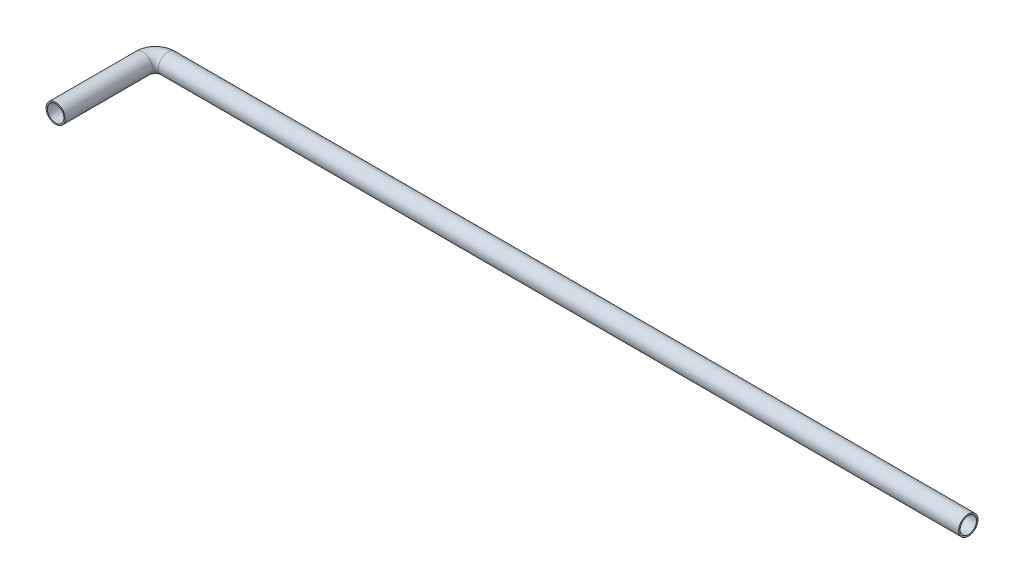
ISO-10303-21;
HEADER;
FILE_DESCRIPTION(('STEP AP214'),'2;1');
FILE_NAME('part.step','',(''),(''),'','','');
FILE_SCHEMA(('AUTOMOTIVE_DESIGN { 1 0 10303 214 1 1 1 1 }'));
ENDSEC;
DATA;
#1=APPLICATION_CONTEXT('core data for automotive mechanical design processes');
#2=APPLICATION_PROTOCOL_DEFINITION('international standard','automotive_design',2000,#1);
#3=PRODUCT_CONTEXT('',#1,'mechanical');
#4=PRODUCT('Part','Part','',(#3));
#5=PRODUCT_RELATED_PRODUCT_CATEGORY('part','',(#4));
#6=PRODUCT_DEFINITION_FORMATION('','',#4);
#7=PRODUCT_DEFINITION_CONTEXT('part definition',#1,'design');
#8=PRODUCT_DEFINITION('design','',#6,#7);
#9=PRODUCT_DEFINITION_SHAPE('','',#8);
#10=(LENGTH_UNIT() NAMED_UNIT(*) SI_UNIT(.MILLI.,.METRE.));
#11=(NAMED_UNIT(*) PLANE_ANGLE_UNIT() SI_UNIT($,.RADIAN.));
#12=(NAMED_UNIT(*) SI_UNIT($,.STERADIAN.) SOLID_ANGLE_UNIT());
#13=UNCERTAINTY_MEASURE_WITH_UNIT(LENGTH_MEASURE(1.E-05),#10,'distance_accuracy_value','');
#14=(GEOMETRIC_REPRESENTATION_CONTEXT(3) GLOBAL_UNCERTAINTY_ASSIGNED_CONTEXT((#13)) GLOBAL_UNIT_ASSIGNED_CONTEXT((#10,
#11,#12)) REPRESENTATION_CONTEXT('',''));
#15=CARTESIAN_POINT('',(0.,0.,0.));
#16=DIRECTION('',(0.,0.,1.));
#17=DIRECTION('',(1.,0.,0.));
#18=AXIS2_PLACEMENT_3D('',#15,#16,#17);
#19=CARTESIAN_POINT('',(0.,0.,50.));
#20=DIRECTION('',(0.,0.,1.));
#21=DIRECTION('',(1.,0.,0.));
#22=AXIS2_PLACEMENT_3D('',#19,#20,#21);
#23=PLANE('',#22);
#24=CARTESIAN_POINT('',(0.,0.,50.));
#25=DIRECTION('',(0.,0.,1.));
#26=DIRECTION('',(1.,0.,0.));
#27=AXIS2_PLACEMENT_3D('',#24,#25,#26);
#28=CIRCLE('',#27,5.5);
#29=CARTESIAN_POINT('',(5.5,0.,50.));
#30=VERTEX_POINT('',#29);
#31=EDGE_CURVE('E11',#30,#30,#28,.T.);
#32=ORIENTED_EDGE('',*,*,#31,.T.);
#33=EDGE_LOOP('',(#32));
#34=FACE_BOUND('',#33,.T.);
#35=CARTESIAN_POINT('',(0.,0.,50.));
#36=DIRECTION('',(0.,0.,1.));
#37=DIRECTION('',(1.,0.,0.));
#38=AXIS2_PLACEMENT_3D('',#35,#36,#37);
#39=CIRCLE('',#38,4.75);
#40=CARTESIAN_POINT('',(4.75,0.,50.));
#41=VERTEX_POINT('',#40);
#42=EDGE_CURVE('E41',#41,#41,#39,.T.);
#43=ORIENTED_EDGE('',*,*,#42,.F.);
#44=EDGE_LOOP('',(#43));
#45=FACE_BOUND('',#44,.T.);
#46=ADVANCED_FACE('F33',(#34,#45),#23,.T.);
#47=CARTESIAN_POINT('',(0.,0.,50.));
#48=DIRECTION('',(0.,0.,-1.));
#49=DIRECTION('',(-1.,0.,0.));
#50=AXIS2_PLACEMENT_3D('',#47,#48,#49);
#51=CYLINDRICAL_SURFACE('',#50,5.5);
#52=ORIENTED_EDGE('',*,*,#31,.F.);
#53=EDGE_LOOP('',(#52));
#54=FACE_BOUND('',#53,.T.);
#55=CARTESIAN_POINT('',(0.,0.,0.));
#56=DIRECTION('',(0.,0.,-1.));
#57=DIRECTION('',(-1.,0.,0.));
#58=AXIS2_PLACEMENT_3D('',#55,#56,#57);
#59=CIRCLE('',#58,5.5);
#60=CARTESIAN_POINT('',(-5.5,0.,0.));
#61=VERTEX_POINT('',#60);
#62=EDGE_CURVE('E61',#61,#61,#59,.T.);
#63=ORIENTED_EDGE('',*,*,#62,.F.);
#64=EDGE_LOOP('',(#63));
#65=FACE_BOUND('',#64,.T.);
#66=ADVANCED_FACE('F35',(#54,#65),#51,.T.);
#67=CARTESIAN_POINT('',(0.,0.,50.));
#68=DIRECTION('',(0.,0.,-1.));
#69=DIRECTION('',(-1.,0.,0.));
#70=AXIS2_PLACEMENT_3D('',#67,#68,#69);
#71=CYLINDRICAL_SURFACE('',#70,4.75);
#72=ORIENTED_EDGE('',*,*,#42,.T.);
#73=EDGE_LOOP('',(#72));
#74=FACE_BOUND('',#73,.T.);
#75=CARTESIAN_POINT('',(0.,0.,0.));
#76=DIRECTION('',(0.,0.,1.));
#77=DIRECTION('',(1.,0.,0.));
#78=AXIS2_PLACEMENT_3D('',#75,#76,#77);
#79=CIRCLE('',#78,4.75);
#80=CARTESIAN_POINT('',(4.75,0.,0.));
#81=VERTEX_POINT('',#80);
#82=EDGE_CURVE('E56',#81,#81,#79,.T.);
#83=ORIENTED_EDGE('',*,*,#82,.F.);
#84=EDGE_LOOP('',(#83));
#85=FACE_BOUND('',#84,.T.);
#86=ADVANCED_FACE('F68',(#74,#85),#71,.F.);
#87=CARTESIAN_POINT('',(7.25877524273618,0.,0.));
#88=DIRECTION('',(0.,1.,0.));
#89=DIRECTION('',(-1.,0.,0.));
#90=AXIS2_PLACEMENT_3D('',#87,#88,#89);
#91=TOROIDAL_SURFACE('',#90,7.25877524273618,4.75);
#92=CARTESIAN_POINT('',(7.2587752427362,0.,-7.25877524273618));
#93=DIRECTION('',(1.,0.,0.));
#94=DIRECTION('',(0.,0.,-1.));
#95=AXIS2_PLACEMENT_3D('',#92,#93,#94);
#96=CIRCLE('',#95,4.75);
#97=CARTESIAN_POINT('',(7.2587752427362,0.,-2.50877524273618));
#98=VERTEX_POINT('',#97);
#99=EDGE_CURVE('E57',#98,#98,#96,.T.);
#100=ORIENTED_EDGE('',*,*,#99,.T.);
#101=EDGE_LOOP('',(#100));
#102=FACE_BOUND('',#101,.T.);
#103=ORIENTED_EDGE('',*,*,#82,.T.);
#104=EDGE_LOOP('',(#103));
#105=FACE_BOUND('',#104,.T.);
#106=ADVANCED_FACE('F80',(#102,#105),#91,.F.);
#107=CARTESIAN_POINT('',(7.25877524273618,0.,0.));
#108=DIRECTION('',(0.,1.,0.));
#109=DIRECTION('',(-1.,0.,0.));
#110=AXIS2_PLACEMENT_3D('',#107,#108,#109);
#111=TOROIDAL_SURFACE('',#110,7.25877524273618,5.5);
#112=CARTESIAN_POINT('',(7.2587752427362,0.,-7.25877524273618));
#113=DIRECTION('',(1.,0.,0.));
#114=DIRECTION('',(0.,0.,-1.));
#115=AXIS2_PLACEMENT_3D('',#112,#113,#114);
#116=CIRCLE('',#115,5.5);
#117=CARTESIAN_POINT('',(7.25877524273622,0.,-12.7587752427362));
#118=VERTEX_POINT('',#117);
#119=EDGE_CURVE('E50',#118,#118,#116,.T.);
#120=ORIENTED_EDGE('',*,*,#119,.F.);
#121=EDGE_LOOP('',(#120));
#122=FACE_BOUND('',#121,.T.);
#123=ORIENTED_EDGE('',*,*,#62,.T.);
#124=EDGE_LOOP('',(#123));
#125=FACE_BOUND('',#124,.T.);
#126=ADVANCED_FACE('F51',(#122,#125),#111,.T.);
#127=CARTESIAN_POINT('',(7.2587752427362,0.,-7.21692777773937));
#128=DIRECTION('',(1.,0.,0.));
#129=DIRECTION('',(0.,0.,-1.));
#130=AXIS2_PLACEMENT_3D('',#127,#128,#129);
#131=PLANE('',#130);
#132=CARTESIAN_POINT('',(7.2587752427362,0.,-7.21692777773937));
#133=DIRECTION('',(1.,0.,0.));
#134=DIRECTION('',(0.,0.,-1.));
#135=AXIS2_PLACEMENT_3D('',#132,#133,#134);
#136=CIRCLE('',#135,5.54184746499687);
#137=EDGE_CURVE('E108',#118,#118,#136,.T.);
#138=ORIENTED_EDGE('',*,*,#137,.F.);
#139=ORIENTED_EDGE('',*,*,#119,.T.);
#140=EDGE_LOOP('',(#138,#139));
#141=FACE_BOUND('',#140,.T.);
#142=ADVANCED_FACE('F83',(#141),#131,.F.);
#143=CARTESIAN_POINT('',(466.258775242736,0.,-7.21692777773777));
#144=DIRECTION('',(1.,0.,0.));
#145=DIRECTION('',(0.,0.,-1.));
#146=AXIS2_PLACEMENT_3D('',#143,#144,#145);
#147=PLANE('',#146);
#148=CARTESIAN_POINT('',(466.258775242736,0.,-7.21692777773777));
#149=DIRECTION('',(1.,0.,0.));
#150=DIRECTION('',(0.,0.,-1.));
#151=AXIS2_PLACEMENT_3D('',#148,#149,#150);
#152=CIRCLE('',#151,5.54184746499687);
#153=CARTESIAN_POINT('',(466.258775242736,0.,-12.7587752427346));
#154=VERTEX_POINT('',#153);
#155=EDGE_CURVE('E110',#154,#154,#152,.T.);
#156=ORIENTED_EDGE('',*,*,#155,.T.);
#157=EDGE_LOOP('',(#156));
#158=FACE_BOUND('',#157,.T.);
#159=CARTESIAN_POINT('',(466.258775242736,0.,-7.21692777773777));
#160=DIRECTION('',(1.,0.,0.));
#161=DIRECTION('',(0.,0.,-1.));
#162=AXIS2_PLACEMENT_3D('',#159,#160,#161);
#163=CIRCLE('',#162,4.7081525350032);
#164=CARTESIAN_POINT('',(466.258775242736,0.,-11.925080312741));
#165=VERTEX_POINT('',#164);
#166=EDGE_CURVE('E106',#165,#165,#163,.T.);
#167=ORIENTED_EDGE('',*,*,#166,.F.);
#168=EDGE_LOOP('',(#167));
#169=FACE_BOUND('',#168,.T.);
#170=ADVANCED_FACE('F95',(#158,#169),#147,.T.);
#171=CARTESIAN_POINT('',(7.2587752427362,0.,-7.21692777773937));
#172=DIRECTION('',(1.,0.,0.));
#173=DIRECTION('',(0.,0.,-1.));
#174=AXIS2_PLACEMENT_3D('',#171,#172,#173);
#175=CIRCLE('',#174,4.7081525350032);
#176=EDGE_CURVE('E46',#98,#98,#175,.T.);
#177=ORIENTED_EDGE('',*,*,#176,.T.);
#178=ORIENTED_EDGE('',*,*,#99,.F.);
#179=EDGE_LOOP('',(#177,#178));
#180=FACE_BOUND('',#179,.T.);
#181=ADVANCED_FACE('F91',(#180),#131,.F.);
#182=CARTESIAN_POINT('',(466.258775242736,0.,-7.21692777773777));
#183=DIRECTION('',(-1.,0.,0.));
#184=DIRECTION('',(0.,0.,1.));
#185=AXIS2_PLACEMENT_3D('',#182,#183,#184);
#186=CYLINDRICAL_SURFACE('',#185,5.54184746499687);
#187=ORIENTED_EDGE('',*,*,#155,.F.);
#188=EDGE_LOOP('',(#187));
#189=FACE_BOUND('',#188,.T.);
#190=ORIENTED_EDGE('',*,*,#137,.T.);
#191=EDGE_LOOP('',(#190));
#192=FACE_BOUND('',#191,.T.);
#193=ADVANCED_FACE('F87',(#189,#192),#186,.T.);
#194=CARTESIAN_POINT('',(466.258775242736,0.,-7.21692777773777));
#195=DIRECTION('',(-1.,0.,0.));
#196=DIRECTION('',(0.,0.,1.));
#197=AXIS2_PLACEMENT_3D('',#194,#195,#196);
#198=CYLINDRICAL_SURFACE('',#197,4.7081525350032);
#199=ORIENTED_EDGE('',*,*,#166,.T.);
#200=EDGE_LOOP('',(#199));
#201=FACE_BOUND('',#200,.T.);
#202=ORIENTED_EDGE('',*,*,#176,.F.);
#203=EDGE_LOOP('',(#202));
#204=FACE_BOUND('',#203,.T.);
#205=ADVANCED_FACE('F90',(#201,#204),#198,.F.);
#206=CLOSED_SHELL('',(#46,#66,#86,#106,#126,#142,#170,#181,#193,#205));
#207=MANIFOLD_SOLID_BREP('B2',#206);
#208=ADVANCED_BREP_SHAPE_REPRESENTATION('',(#18,#207),#14);
#209=SHAPE_DEFINITION_REPRESENTATION(#9,#208);
ENDSEC;
END-ISO-10303-21;
